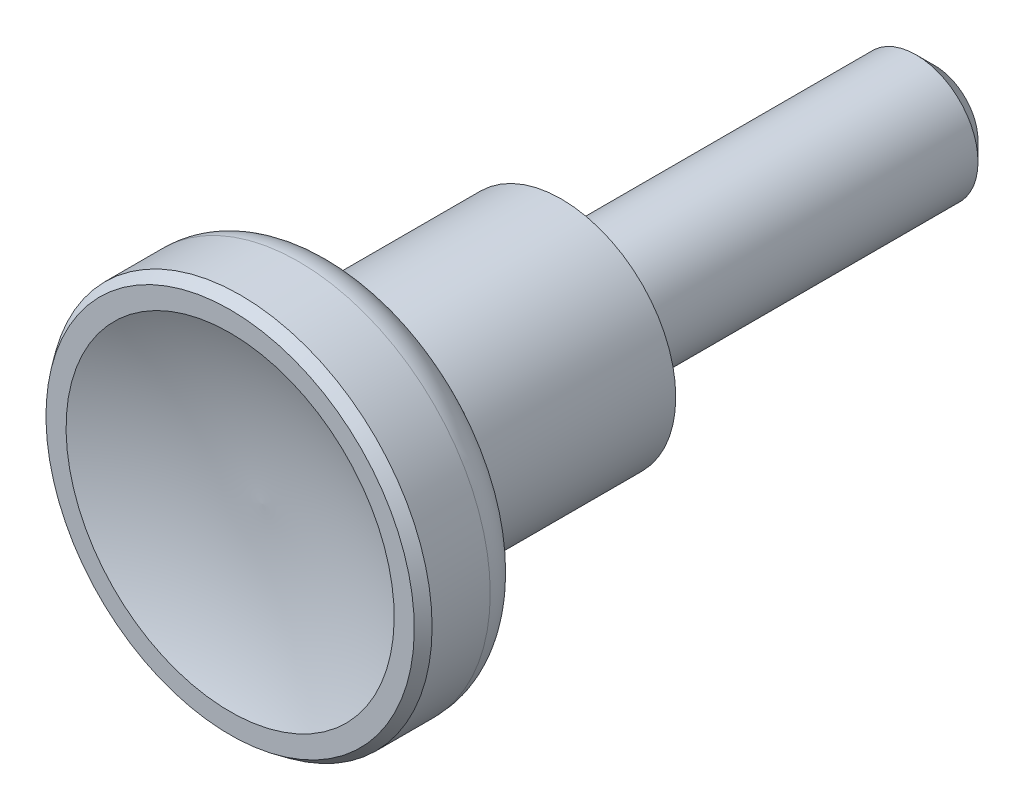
ISO-10303-21;
HEADER;
FILE_DESCRIPTION(('STEP AP214'),'2;1');
FILE_NAME('part.step','',(''),(''),'','','');
FILE_SCHEMA(('AUTOMOTIVE_DESIGN { 1 0 10303 214 1 1 1 1 }'));
ENDSEC;
DATA;
#1=APPLICATION_CONTEXT('core data for automotive mechanical design processes');
#2=APPLICATION_PROTOCOL_DEFINITION('international standard','automotive_design',2000,#1);
#3=PRODUCT_CONTEXT('',#1,'mechanical');
#4=PRODUCT('Part','Part','',(#3));
#5=PRODUCT_RELATED_PRODUCT_CATEGORY('part','',(#4));
#6=PRODUCT_DEFINITION_FORMATION('','',#4);
#7=PRODUCT_DEFINITION_CONTEXT('part definition',#1,'design');
#8=PRODUCT_DEFINITION('design','',#6,#7);
#9=PRODUCT_DEFINITION_SHAPE('','',#8);
#10=(LENGTH_UNIT() NAMED_UNIT(*) SI_UNIT(.MILLI.,.METRE.));
#11=(NAMED_UNIT(*) PLANE_ANGLE_UNIT() SI_UNIT($,.RADIAN.));
#12=(NAMED_UNIT(*) SI_UNIT($,.STERADIAN.) SOLID_ANGLE_UNIT());
#13=UNCERTAINTY_MEASURE_WITH_UNIT(LENGTH_MEASURE(1.E-05),#10,'distance_accuracy_value','');
#14=(GEOMETRIC_REPRESENTATION_CONTEXT(3) GLOBAL_UNCERTAINTY_ASSIGNED_CONTEXT((#13)) GLOBAL_UNIT_ASSIGNED_CONTEXT((#10,
#11,#12)) REPRESENTATION_CONTEXT('',''));
#15=CARTESIAN_POINT('',(0.,0.,0.));
#16=DIRECTION('',(0.,0.,1.));
#17=DIRECTION('',(1.,0.,0.));
#18=AXIS2_PLACEMENT_3D('',#15,#16,#17);
#19=CARTESIAN_POINT('',(9.25,0.,0.200000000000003));
#20=DIRECTION('',(0.,0.,1.));
#21=DIRECTION('',(0.,-1.,0.));
#22=AXIS2_PLACEMENT_3D('',#19,#20,#21);
#23=PLANE('',#22);
#24=CARTESIAN_POINT('',(0.,0.,0.200000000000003));
#25=DIRECTION('',(0.,0.,-1.));
#26=DIRECTION('',(0.,1.,0.));
#27=AXIS2_PLACEMENT_3D('',#24,#25,#26);
#28=CIRCLE('',#27,6.);
#29=CARTESIAN_POINT('',(0.,6.,0.200000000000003));
#30=VERTEX_POINT('',#29);
#31=EDGE_CURVE('E129',#30,#30,#28,.T.);
#32=ORIENTED_EDGE('',*,*,#31,.F.);
#33=EDGE_LOOP('',(#32));
#34=FACE_BOUND('',#33,.T.);
#35=CARTESIAN_POINT('',(0.,0.,0.200000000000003));
#36=DIRECTION('',(0.,0.,-1.));
#37=DIRECTION('',(0.,1.,0.));
#38=AXIS2_PLACEMENT_3D('',#35,#36,#37);
#39=CIRCLE('',#38,9.25);
#40=CARTESIAN_POINT('',(0.,9.25,0.200000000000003));
#41=VERTEX_POINT('',#40);
#42=EDGE_CURVE('E104',#41,#41,#39,.T.);
#43=ORIENTED_EDGE('',*,*,#42,.T.);
#44=EDGE_LOOP('',(#43));
#45=FACE_BOUND('',#44,.T.);
#46=ADVANCED_FACE('F14',(#34,#45),#23,.F.);
#47=CARTESIAN_POINT('',(0.,0.,-5.03212408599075));
#48=DIRECTION('',(0.,0.,-1.));
#49=DIRECTION('',(0.,1.,0.));
#50=AXIS2_PLACEMENT_3D('',#47,#48,#49);
#51=CYLINDRICAL_SURFACE('',#50,9.25);
#52=CARTESIAN_POINT('',(0.,0.,17.));
#53=DIRECTION('',(0.,0.,-1.));
#54=DIRECTION('',(0.,1.,0.));
#55=AXIS2_PLACEMENT_3D('',#52,#53,#54);
#56=CIRCLE('',#55,9.25);
#57=CARTESIAN_POINT('',(0.,9.25,17.));
#58=VERTEX_POINT('',#57);
#59=EDGE_CURVE('E101',#58,#58,#56,.T.);
#60=ORIENTED_EDGE('',*,*,#59,.T.);
#61=EDGE_LOOP('',(#60));
#62=FACE_BOUND('',#61,.T.);
#63=ORIENTED_EDGE('',*,*,#42,.F.);
#64=EDGE_LOOP('',(#63));
#65=FACE_BOUND('',#64,.T.);
#66=ADVANCED_FACE('F44',(#62,#65),#51,.T.);
#67=CARTESIAN_POINT('',(0.,0.,16.8985536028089));
#68=DIRECTION('',(0.,0.,-1.));
#69=DIRECTION('',(0.,1.,0.));
#70=AXIS2_PLACEMENT_3D('',#67,#68,#69);
#71=TOROIDAL_SURFACE('',#70,10.0001743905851,0.757002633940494);
#72=ORIENTED_EDGE('',*,*,#59,.F.);
#73=EDGE_LOOP('',(#72));
#74=FACE_BOUND('',#73,.T.);
#75=CARTESIAN_POINT('',(0.,0.,17.6315572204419));
#76=DIRECTION('',(0.,0.,-1.));
#77=DIRECTION('',(0.,1.,0.));
#78=AXIS2_PLACEMENT_3D('',#75,#76,#77);
#79=CIRCLE('',#78,9.81107472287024);
#80=CARTESIAN_POINT('',(0.,9.81107472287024,17.6315572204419));
#81=VERTEX_POINT('',#80);
#82=EDGE_CURVE('E98',#81,#81,#79,.T.);
#83=ORIENTED_EDGE('',*,*,#82,.T.);
#84=EDGE_LOOP('',(#83));
#85=FACE_BOUND('',#84,.T.);
#86=ADVANCED_FACE('F50',(#74,#85),#71,.F.);
#87=CARTESIAN_POINT('',(0.,0.,17.6315572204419));
#88=DIRECTION('',(0.,0.,1.));
#89=DIRECTION('',(0.,-1.,0.));
#90=AXIS2_PLACEMENT_3D('',#87,#88,#89);
#91=CONICAL_SURFACE('',#90,9.81107472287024,1.30899528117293);
#92=CARTESIAN_POINT('',(0.,0.,18.5601110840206));
#93=DIRECTION('',(0.,0.,-1.));
#94=DIRECTION('',(0.,1.,0.));
#95=AXIS2_PLACEMENT_3D('',#92,#93,#94);
#96=CIRCLE('',#95,13.2764619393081);
#97=CARTESIAN_POINT('',(0.,13.2764619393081,18.5601110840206));
#98=VERTEX_POINT('',#97);
#99=EDGE_CURVE('E95',#98,#98,#96,.T.);
#100=ORIENTED_EDGE('',*,*,#99,.T.);
#101=EDGE_LOOP('',(#100));
#102=FACE_BOUND('',#101,.T.);
#103=ORIENTED_EDGE('',*,*,#82,.F.);
#104=EDGE_LOOP('',(#103));
#105=FACE_BOUND('',#104,.T.);
#106=ADVANCED_FACE('F58',(#102,#105),#91,.T.);
#107=CARTESIAN_POINT('',(0.,0.,21.4578872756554));
#108=DIRECTION('',(0.,0.,-1.));
#109=DIRECTION('',(0.,1.,0.));
#110=AXIS2_PLACEMENT_3D('',#107,#108,#109);
#111=TOROIDAL_SURFACE('',#110,12.5,3.);
#112=CARTESIAN_POINT('',(0.,0.,21.4578872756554));
#113=DIRECTION('',(0.,0.,-1.));
#114=DIRECTION('',(0.,1.,0.));
#115=AXIS2_PLACEMENT_3D('',#112,#113,#114);
#116=CIRCLE('',#115,15.5);
#117=CARTESIAN_POINT('',(0.,15.5,21.4578872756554));
#118=VERTEX_POINT('',#117);
#119=EDGE_CURVE('E86',#118,#118,#116,.T.);
#120=ORIENTED_EDGE('',*,*,#119,.T.);
#121=EDGE_LOOP('',(#120));
#122=FACE_BOUND('',#121,.T.);
#123=ORIENTED_EDGE('',*,*,#99,.F.);
#124=EDGE_LOOP('',(#123));
#125=FACE_BOUND('',#124,.T.);
#126=ADVANCED_FACE('F62',(#122,#125),#111,.T.);
#127=CARTESIAN_POINT('',(0.,0.,-5.03212408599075));
#128=DIRECTION('',(0.,0.,-1.));
#129=DIRECTION('',(0.,1.,0.));
#130=AXIS2_PLACEMENT_3D('',#127,#128,#129);
#131=CYLINDRICAL_SURFACE('',#130,15.5);
#132=CARTESIAN_POINT('',(0.,0.,26.1604195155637));
#133=DIRECTION('',(0.,0.,-1.));
#134=DIRECTION('',(0.,1.,0.));
#135=AXIS2_PLACEMENT_3D('',#132,#133,#134);
#136=CIRCLE('',#135,15.5);
#137=CARTESIAN_POINT('',(0.,15.5,26.1604195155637));
#138=VERTEX_POINT('',#137);
#139=EDGE_CURVE('E79',#138,#138,#136,.T.);
#140=ORIENTED_EDGE('',*,*,#139,.T.);
#141=EDGE_LOOP('',(#140));
#142=FACE_BOUND('',#141,.T.);
#143=ORIENTED_EDGE('',*,*,#119,.F.);
#144=EDGE_LOOP('',(#143));
#145=FACE_BOUND('',#144,.T.);
#146=ADVANCED_FACE('F66',(#142,#145),#131,.T.);
#147=CARTESIAN_POINT('',(0.,0.,27.));
#148=DIRECTION('',(0.,0.,-1.));
#149=DIRECTION('',(0.,1.,0.));
#150=AXIS2_PLACEMENT_3D('',#147,#148,#149);
#151=CONICAL_SURFACE('',#150,14.8985964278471,0.621591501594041);
#152=ORIENTED_EDGE('',*,*,#139,.F.);
#153=EDGE_LOOP('',(#152));
#154=FACE_BOUND('',#153,.T.);
#155=CARTESIAN_POINT('',(0.,0.,27.));
#156=DIRECTION('',(0.,0.,-1.));
#157=DIRECTION('',(0.,1.,0.));
#158=AXIS2_PLACEMENT_3D('',#155,#156,#157);
#159=CIRCLE('',#158,14.8985964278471);
#160=CARTESIAN_POINT('',(0.,14.8985964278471,27.));
#161=VERTEX_POINT('',#160);
#162=EDGE_CURVE('E82',#161,#161,#159,.T.);
#163=ORIENTED_EDGE('',*,*,#162,.T.);
#164=EDGE_LOOP('',(#163));
#165=FACE_BOUND('',#164,.T.);
#166=ADVANCED_FACE('F39',(#154,#165),#151,.T.);
#167=CARTESIAN_POINT('',(14.8985964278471,0.,27.));
#168=DIRECTION('',(0.,0.,1.));
#169=DIRECTION('',(0.,-1.,0.));
#170=AXIS2_PLACEMENT_3D('',#167,#168,#169);
#171=PLANE('',#170);
#172=CARTESIAN_POINT('',(0.,0.,27.));
#173=DIRECTION('',(0.,0.,-1.));
#174=DIRECTION('',(0.,1.,0.));
#175=AXIS2_PLACEMENT_3D('',#172,#173,#174);
#176=CIRCLE('',#175,13.2712747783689);
#177=CARTESIAN_POINT('',(0.,13.2712747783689,27.));
#178=VERTEX_POINT('',#177);
#179=EDGE_CURVE('E84',#178,#178,#176,.T.);
#180=ORIENTED_EDGE('',*,*,#179,.T.);
#181=EDGE_LOOP('',(#180));
#182=FACE_BOUND('',#181,.T.);
#183=ORIENTED_EDGE('',*,*,#162,.F.);
#184=EDGE_LOOP('',(#183));
#185=FACE_BOUND('',#184,.T.);
#186=ADVANCED_FACE('F27',(#182,#185),#171,.T.);
#187=CARTESIAN_POINT('',(0.,1.00000000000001,54.4628043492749));
#188=DIRECTION('',(-1.,0.,0.));
#189=DIRECTION('',(0.,1.,0.));
#190=AXIS2_PLACEMENT_3D('',#187,#188,#189);
#191=CIRCLE('',#190,30.0797241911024);
#192=TRIMMED_CURVE('',#191,(PARAMETER_VALUE(-1.60404743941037)),
(PARAMETER_VALUE(1.60404743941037)),.T.,.PARAMETER.);
#193=CARTESIAN_POINT('',(0.,0.,54.4628043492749));
#194=DIRECTION('',(0.,0.,-1.));
#195=AXIS1_PLACEMENT('',#193,#194);
#196=SURFACE_OF_REVOLUTION('',#192,#195);
#197=ORIENTED_EDGE('',*,*,#179,.F.);
#198=EDGE_LOOP('',(#197));
#199=FACE_BOUND('',#198,.T.);
#200=CARTESIAN_POINT('',(0.,0.,24.3997072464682));
#201=VERTEX_POINT('',#200);
#202=VERTEX_LOOP('',#201);
#203=FACE_BOUND('',#202,.T.);
#204=ADVANCED_FACE('F24',(#199,#203),#196,.F.);
#205=CARTESIAN_POINT('',(4.99999999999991,0.,-30.));
#206=DIRECTION('',(0.,0.,1.));
#207=DIRECTION('',(0.,-1.,0.));
#208=AXIS2_PLACEMENT_3D('',#205,#206,#207);
#209=PLANE('',#208);
#210=CARTESIAN_POINT('',(0.,0.,-30.));
#211=DIRECTION('',(0.,0.,1.));
#212=DIRECTION('',(1.,0.,0.));
#213=AXIS2_PLACEMENT_3D('',#210,#211,#212);
#214=CIRCLE('',#213,3.5);
#215=CARTESIAN_POINT('',(3.5,0.,-30.));
#216=VERTEX_POINT('',#215);
#217=EDGE_CURVE('E21',#216,#216,#214,.F.);
#218=ORIENTED_EDGE('',*,*,#217,.T.);
#219=EDGE_LOOP('',(#218));
#220=FACE_BOUND('',#219,.T.);
#221=ADVANCED_FACE('F26',(#220),#209,.F.);
#222=CARTESIAN_POINT('',(0.,0.,-5.03212408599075));
#223=DIRECTION('',(0.,0.,-1.));
#224=DIRECTION('',(0.,1.,0.));
#225=AXIS2_PLACEMENT_3D('',#222,#223,#224);
#226=CYLINDRICAL_SURFACE('',#225,5.);
#227=CARTESIAN_POINT('',(0.,0.,-28.5));
#228=DIRECTION('',(0.,0.,1.));
#229=DIRECTION('',(1.,0.,0.));
#230=AXIS2_PLACEMENT_3D('',#227,#228,#229);
#231=CIRCLE('',#230,5.);
#232=CARTESIAN_POINT('',(5.,0.,-28.5));
#233=VERTEX_POINT('',#232);
#234=EDGE_CURVE('E9',#233,#233,#231,.T.);
#235=ORIENTED_EDGE('',*,*,#234,.T.);
#236=EDGE_LOOP('',(#235));
#237=FACE_BOUND('',#236,.T.);
#238=CARTESIAN_POINT('',(0.,0.,0.));
#239=DIRECTION('',(0.,0.,-1.));
#240=DIRECTION('',(0.,1.,0.));
#241=AXIS2_PLACEMENT_3D('',#238,#239,#240);
#242=CIRCLE('',#241,5.);
#243=CARTESIAN_POINT('',(0.,5.,0.));
#244=VERTEX_POINT('',#243);
#245=EDGE_CURVE('E89',#244,#244,#242,.T.);
#246=ORIENTED_EDGE('',*,*,#245,.T.);
#247=EDGE_LOOP('',(#246));
#248=FACE_BOUND('',#247,.T.);
#249=ADVANCED_FACE('F36',(#237,#248),#226,.T.);
#250=CARTESIAN_POINT('',(5.99999999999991,0.,0.));
#251=DIRECTION('',(0.,0.,1.));
#252=DIRECTION('',(0.,-1.,0.));
#253=AXIS2_PLACEMENT_3D('',#250,#251,#252);
#254=PLANE('',#253);
#255=ORIENTED_EDGE('',*,*,#245,.F.);
#256=EDGE_LOOP('',(#255));
#257=FACE_BOUND('',#256,.T.);
#258=CARTESIAN_POINT('',(0.,0.,0.));
#259=DIRECTION('',(0.,0.,-1.));
#260=DIRECTION('',(0.,1.,0.));
#261=AXIS2_PLACEMENT_3D('',#258,#259,#260);
#262=CIRCLE('',#261,6.);
#263=CARTESIAN_POINT('',(0.,6.,0.));
#264=VERTEX_POINT('',#263);
#265=EDGE_CURVE('E127',#264,#264,#262,.T.);
#266=ORIENTED_EDGE('',*,*,#265,.T.);
#267=EDGE_LOOP('',(#266));
#268=FACE_BOUND('',#267,.T.);
#269=ADVANCED_FACE('F116',(#257,#268),#254,.F.);
#270=CARTESIAN_POINT('',(0.,0.,-5.03212408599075));
#271=DIRECTION('',(0.,0.,-1.));
#272=DIRECTION('',(0.,1.,0.));
#273=AXIS2_PLACEMENT_3D('',#270,#271,#272);
#274=CYLINDRICAL_SURFACE('',#273,6.);
#275=ORIENTED_EDGE('',*,*,#265,.F.);
#276=EDGE_LOOP('',(#275));
#277=FACE_BOUND('',#276,.T.);
#278=ORIENTED_EDGE('',*,*,#31,.T.);
#279=EDGE_LOOP('',(#278));
#280=FACE_BOUND('',#279,.T.);
#281=ADVANCED_FACE('F110',(#277,#280),#274,.T.);
#282=CARTESIAN_POINT('',(0.,0.,-30.));
#283=DIRECTION('',(0.,0.,1.));
#284=DIRECTION('',(1.,0.,0.));
#285=AXIS2_PLACEMENT_3D('',#282,#283,#284);
#286=CONICAL_SURFACE('',#285,3.5,0.785398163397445);
#287=ORIENTED_EDGE('',*,*,#234,.F.);
#288=EDGE_LOOP('',(#287));
#289=FACE_BOUND('',#288,.T.);
#290=ORIENTED_EDGE('',*,*,#217,.F.);
#291=EDGE_LOOP('',(#290));
#292=FACE_BOUND('',#291,.T.);
#293=ADVANCED_FACE('F16',(#289,#292),#286,.T.);
#294=CLOSED_SHELL('',(#46,#66,#86,#106,#126,#146,#166,#186,#204,#221,#249,#269,#281,#293));
#295=MANIFOLD_SOLID_BREP('B1',#294);
#296=ADVANCED_BREP_SHAPE_REPRESENTATION('',(#18,#295),#14);
#297=SHAPE_DEFINITION_REPRESENTATION(#9,#296);
ENDSEC;
END-ISO-10303-21;
